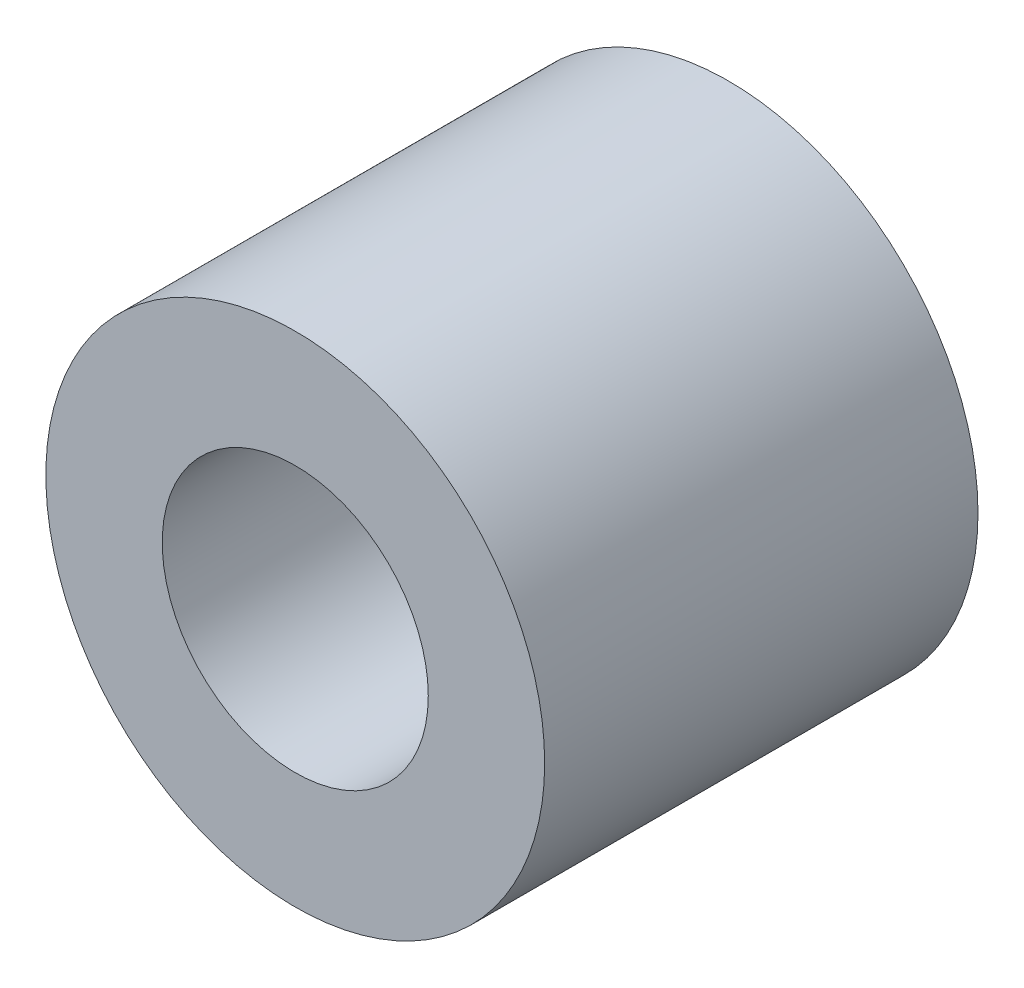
ISO-10303-21;
HEADER;
FILE_DESCRIPTION(('STEP AP214'),'2;1');
FILE_NAME('part.step','',(''),(''),'','','');
FILE_SCHEMA(('AUTOMOTIVE_DESIGN { 1 0 10303 214 1 1 1 1 }'));
ENDSEC;
DATA;
#1=APPLICATION_CONTEXT('core data for automotive mechanical design processes');
#2=APPLICATION_PROTOCOL_DEFINITION('international standard','automotive_design',2000,#1);
#3=PRODUCT_CONTEXT('',#1,'mechanical');
#4=PRODUCT('Part','Part','',(#3));
#5=PRODUCT_RELATED_PRODUCT_CATEGORY('part','',(#4));
#6=PRODUCT_DEFINITION_FORMATION('','',#4);
#7=PRODUCT_DEFINITION_CONTEXT('part definition',#1,'design');
#8=PRODUCT_DEFINITION('design','',#6,#7);
#9=PRODUCT_DEFINITION_SHAPE('','',#8);
#10=(LENGTH_UNIT() NAMED_UNIT(*) SI_UNIT(.MILLI.,.METRE.));
#11=(NAMED_UNIT(*) PLANE_ANGLE_UNIT() SI_UNIT($,.RADIAN.));
#12=(NAMED_UNIT(*) SI_UNIT($,.STERADIAN.) SOLID_ANGLE_UNIT());
#13=UNCERTAINTY_MEASURE_WITH_UNIT(LENGTH_MEASURE(1.E-05),#10,'distance_accuracy_value','');
#14=(GEOMETRIC_REPRESENTATION_CONTEXT(3) GLOBAL_UNCERTAINTY_ASSIGNED_CONTEXT((#13)) GLOBAL_UNIT_ASSIGNED_CONTEXT((#10,
#11,#12)) REPRESENTATION_CONTEXT('',''));
#15=CARTESIAN_POINT('',(0.,0.,0.));
#16=DIRECTION('',(0.,0.,1.));
#17=DIRECTION('',(1.,0.,0.));
#18=AXIS2_PLACEMENT_3D('',#15,#16,#17);
#19=CARTESIAN_POINT('',(0.,0.,6.515));
#20=DIRECTION('',(0.,0.,1.));
#21=DIRECTION('',(1.,0.,0.));
#22=AXIS2_PLACEMENT_3D('',#19,#20,#21);
#23=PLANE('',#22);
#24=CARTESIAN_POINT('',(0.,0.,6.515));
#25=DIRECTION('',(0.,0.,1.));
#26=DIRECTION('',(1.,0.,0.));
#27=AXIS2_PLACEMENT_3D('',#24,#25,#26);
#28=CIRCLE('',#27,7.5);
#29=CARTESIAN_POINT('',(7.5,0.,6.515));
#30=VERTEX_POINT('',#29);
#31=EDGE_CURVE('E10',#30,#30,#28,.T.);
#32=ORIENTED_EDGE('',*,*,#31,.T.);
#33=EDGE_LOOP('',(#32));
#34=FACE_BOUND('',#33,.T.);
#35=CARTESIAN_POINT('',(0.,0.,6.515));
#36=DIRECTION('',(0.,0.,1.));
#37=DIRECTION('',(1.,0.,0.));
#38=AXIS2_PLACEMENT_3D('',#35,#36,#37);
#39=CIRCLE('',#38,4.);
#40=CARTESIAN_POINT('',(4.,0.,6.515));
#41=VERTEX_POINT('',#40);
#42=EDGE_CURVE('E46',#41,#41,#39,.T.);
#43=ORIENTED_EDGE('',*,*,#42,.F.);
#44=EDGE_LOOP('',(#43));
#45=FACE_BOUND('',#44,.T.);
#46=ADVANCED_FACE('F35',(#34,#45),#23,.T.);
#47=CARTESIAN_POINT('',(0.,0.,-6.515));
#48=DIRECTION('',(0.,0.,1.));
#49=DIRECTION('',(1.,0.,0.));
#50=AXIS2_PLACEMENT_3D('',#47,#48,#49);
#51=PLANE('',#50);
#52=CARTESIAN_POINT('',(0.,0.,-6.515));
#53=DIRECTION('',(0.,0.,1.));
#54=DIRECTION('',(1.,0.,0.));
#55=AXIS2_PLACEMENT_3D('',#52,#53,#54);
#56=CIRCLE('',#55,7.5);
#57=CARTESIAN_POINT('',(7.5,0.,-6.515));
#58=VERTEX_POINT('',#57);
#59=EDGE_CURVE('E39',#58,#58,#56,.T.);
#60=ORIENTED_EDGE('',*,*,#59,.F.);
#61=EDGE_LOOP('',(#60));
#62=FACE_BOUND('',#61,.T.);
#63=CARTESIAN_POINT('',(0.,0.,-6.515));
#64=DIRECTION('',(0.,0.,1.));
#65=DIRECTION('',(1.,0.,0.));
#66=AXIS2_PLACEMENT_3D('',#63,#64,#65);
#67=CIRCLE('',#66,4.);
#68=CARTESIAN_POINT('',(4.,0.,-6.515));
#69=VERTEX_POINT('',#68);
#70=EDGE_CURVE('E48',#69,#69,#67,.T.);
#71=ORIENTED_EDGE('',*,*,#70,.T.);
#72=EDGE_LOOP('',(#71));
#73=FACE_BOUND('',#72,.T.);
#74=ADVANCED_FACE('F58',(#62,#73),#51,.F.);
#75=CARTESIAN_POINT('',(0.,0.,6.515));
#76=DIRECTION('',(0.,0.,-1.));
#77=DIRECTION('',(-1.,0.,0.));
#78=AXIS2_PLACEMENT_3D('',#75,#76,#77);
#79=CYLINDRICAL_SURFACE('',#78,7.5);
#80=ORIENTED_EDGE('',*,*,#31,.F.);
#81=EDGE_LOOP('',(#80));
#82=FACE_BOUND('',#81,.T.);
#83=ORIENTED_EDGE('',*,*,#59,.T.);
#84=EDGE_LOOP('',(#83));
#85=FACE_BOUND('',#84,.T.);
#86=ADVANCED_FACE('F37',(#82,#85),#79,.T.);
#87=CARTESIAN_POINT('',(0.,0.,6.515));
#88=DIRECTION('',(0.,0.,-1.));
#89=DIRECTION('',(-1.,0.,0.));
#90=AXIS2_PLACEMENT_3D('',#87,#88,#89);
#91=CYLINDRICAL_SURFACE('',#90,4.);
#92=ORIENTED_EDGE('',*,*,#42,.T.);
#93=EDGE_LOOP('',(#92));
#94=FACE_BOUND('',#93,.T.);
#95=ORIENTED_EDGE('',*,*,#70,.F.);
#96=EDGE_LOOP('',(#95));
#97=FACE_BOUND('',#96,.T.);
#98=ADVANCED_FACE('F54',(#94,#97),#91,.F.);
#99=CLOSED_SHELL('',(#46,#74,#86,#98));
#100=MANIFOLD_SOLID_BREP('B2',#99);
#101=ADVANCED_BREP_SHAPE_REPRESENTATION('',(#18,#100),#14);
#102=SHAPE_DEFINITION_REPRESENTATION(#9,#101);
ENDSEC;
END-ISO-10303-21;
